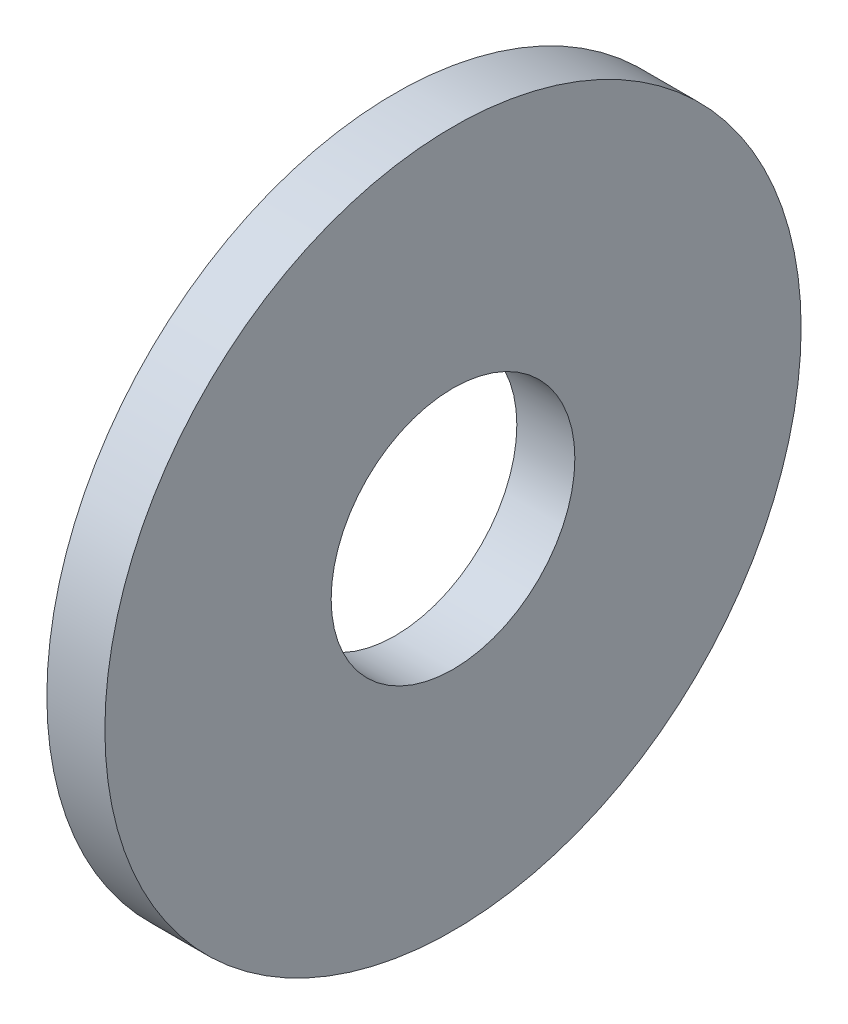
ISO-10303-21;
HEADER;
FILE_DESCRIPTION(('STEP AP214'),'2;1');
FILE_NAME('part.step','',(''),(''),'','','');
FILE_SCHEMA(('AUTOMOTIVE_DESIGN { 1 0 10303 214 1 1 1 1 }'));
ENDSEC;
DATA;
#1=APPLICATION_CONTEXT('core data for automotive mechanical design processes');
#2=APPLICATION_PROTOCOL_DEFINITION('international standard','automotive_design',2000,#1);
#3=PRODUCT_CONTEXT('',#1,'mechanical');
#4=PRODUCT('Part','Part','',(#3));
#5=PRODUCT_RELATED_PRODUCT_CATEGORY('part','',(#4));
#6=PRODUCT_DEFINITION_FORMATION('','',#4);
#7=PRODUCT_DEFINITION_CONTEXT('part definition',#1,'design');
#8=PRODUCT_DEFINITION('design','',#6,#7);
#9=PRODUCT_DEFINITION_SHAPE('','',#8);
#10=(LENGTH_UNIT() NAMED_UNIT(*) SI_UNIT(.MILLI.,.METRE.));
#11=(NAMED_UNIT(*) PLANE_ANGLE_UNIT() SI_UNIT($,.RADIAN.));
#12=(NAMED_UNIT(*) SI_UNIT($,.STERADIAN.) SOLID_ANGLE_UNIT());
#13=UNCERTAINTY_MEASURE_WITH_UNIT(LENGTH_MEASURE(1.E-05),#10,'distance_accuracy_value','');
#14=(GEOMETRIC_REPRESENTATION_CONTEXT(3) GLOBAL_UNCERTAINTY_ASSIGNED_CONTEXT((#13)) GLOBAL_UNIT_ASSIGNED_CONTEXT((#10,
#11,#12)) REPRESENTATION_CONTEXT('',''));
#15=CARTESIAN_POINT('',(0.,0.,0.));
#16=DIRECTION('',(0.,0.,1.));
#17=DIRECTION('',(1.,0.,0.));
#18=AXIS2_PLACEMENT_3D('',#15,#16,#17);
#19=CARTESIAN_POINT('',(-7.4558363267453,0.,0.));
#20=DIRECTION('',(-1.,0.,0.));
#21=DIRECTION('',(0.,0.,1.));
#22=AXIS2_PLACEMENT_3D('',#19,#20,#21);
#23=CYLINDRICAL_SURFACE('',#22,4.20000000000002);
#24=CARTESIAN_POINT('',(2.,0.,0.));
#25=DIRECTION('',(-1.,0.,0.));
#26=DIRECTION('',(0.,0.,1.));
#27=AXIS2_PLACEMENT_3D('',#24,#25,#26);
#28=CIRCLE('',#27,4.20000000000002);
#29=CARTESIAN_POINT('',(2.,0.,4.20000000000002));
#30=VERTEX_POINT('',#29);
#31=EDGE_CURVE('E10',#30,#30,#28,.T.);
#32=ORIENTED_EDGE('',*,*,#31,.F.);
#33=EDGE_LOOP('',(#32));
#34=FACE_BOUND('',#33,.T.);
#35=CARTESIAN_POINT('',(0.,0.,0.));
#36=DIRECTION('',(-1.,0.,0.));
#37=DIRECTION('',(0.,0.,1.));
#38=AXIS2_PLACEMENT_3D('',#35,#36,#37);
#39=CIRCLE('',#38,4.20000000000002);
#40=CARTESIAN_POINT('',(0.,0.,4.20000000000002));
#41=VERTEX_POINT('',#40);
#42=EDGE_CURVE('E42',#41,#41,#39,.T.);
#43=ORIENTED_EDGE('',*,*,#42,.T.);
#44=EDGE_LOOP('',(#43));
#45=FACE_BOUND('',#44,.T.);
#46=ADVANCED_FACE('F28',(#34,#45),#23,.F.);
#47=CARTESIAN_POINT('',(2.,4.20000000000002,0.));
#48=DIRECTION('',(-1.,0.,0.));
#49=DIRECTION('',(0.,0.,1.));
#50=AXIS2_PLACEMENT_3D('',#47,#48,#49);
#51=PLANE('',#50);
#52=CARTESIAN_POINT('',(2.,0.,0.));
#53=DIRECTION('',(-1.,0.,0.));
#54=DIRECTION('',(0.,0.,1.));
#55=AXIS2_PLACEMENT_3D('',#52,#53,#54);
#56=CIRCLE('',#55,12.);
#57=CARTESIAN_POINT('',(2.,0.,12.));
#58=VERTEX_POINT('',#57);
#59=EDGE_CURVE('E34',#58,#58,#56,.T.);
#60=ORIENTED_EDGE('',*,*,#59,.F.);
#61=EDGE_LOOP('',(#60));
#62=FACE_BOUND('',#61,.T.);
#63=ORIENTED_EDGE('',*,*,#31,.T.);
#64=EDGE_LOOP('',(#63));
#65=FACE_BOUND('',#64,.T.);
#66=ADVANCED_FACE('F57',(#62,#65),#51,.F.);
#67=CARTESIAN_POINT('',(-7.4558363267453,0.,0.));
#68=DIRECTION('',(-1.,0.,0.));
#69=DIRECTION('',(0.,0.,1.));
#70=AXIS2_PLACEMENT_3D('',#67,#68,#69);
#71=CYLINDRICAL_SURFACE('',#70,12.);
#72=CARTESIAN_POINT('',(0.,0.,0.));
#73=DIRECTION('',(-1.,0.,0.));
#74=DIRECTION('',(0.,0.,1.));
#75=AXIS2_PLACEMENT_3D('',#72,#73,#74);
#76=CIRCLE('',#75,12.);
#77=CARTESIAN_POINT('',(0.,0.,12.));
#78=VERTEX_POINT('',#77);
#79=EDGE_CURVE('E38',#78,#78,#76,.T.);
#80=ORIENTED_EDGE('',*,*,#79,.F.);
#81=EDGE_LOOP('',(#80));
#82=FACE_BOUND('',#81,.T.);
#83=ORIENTED_EDGE('',*,*,#59,.T.);
#84=EDGE_LOOP('',(#83));
#85=FACE_BOUND('',#84,.T.);
#86=ADVANCED_FACE('F52',(#82,#85),#71,.T.);
#87=CARTESIAN_POINT('',(0.,12.,0.));
#88=DIRECTION('',(1.,0.,0.));
#89=DIRECTION('',(0.,0.,-1.));
#90=AXIS2_PLACEMENT_3D('',#87,#88,#89);
#91=PLANE('',#90);
#92=ORIENTED_EDGE('',*,*,#42,.F.);
#93=EDGE_LOOP('',(#92));
#94=FACE_BOUND('',#93,.T.);
#95=ORIENTED_EDGE('',*,*,#79,.T.);
#96=EDGE_LOOP('',(#95));
#97=FACE_BOUND('',#96,.T.);
#98=ADVANCED_FACE('F49',(#94,#97),#91,.F.);
#99=CLOSED_SHELL('',(#46,#66,#86,#98));
#100=MANIFOLD_SOLID_BREP('B2',#99);
#101=ADVANCED_BREP_SHAPE_REPRESENTATION('',(#18,#100),#14);
#102=SHAPE_DEFINITION_REPRESENTATION(#9,#101);
ENDSEC;
END-ISO-10303-21;
